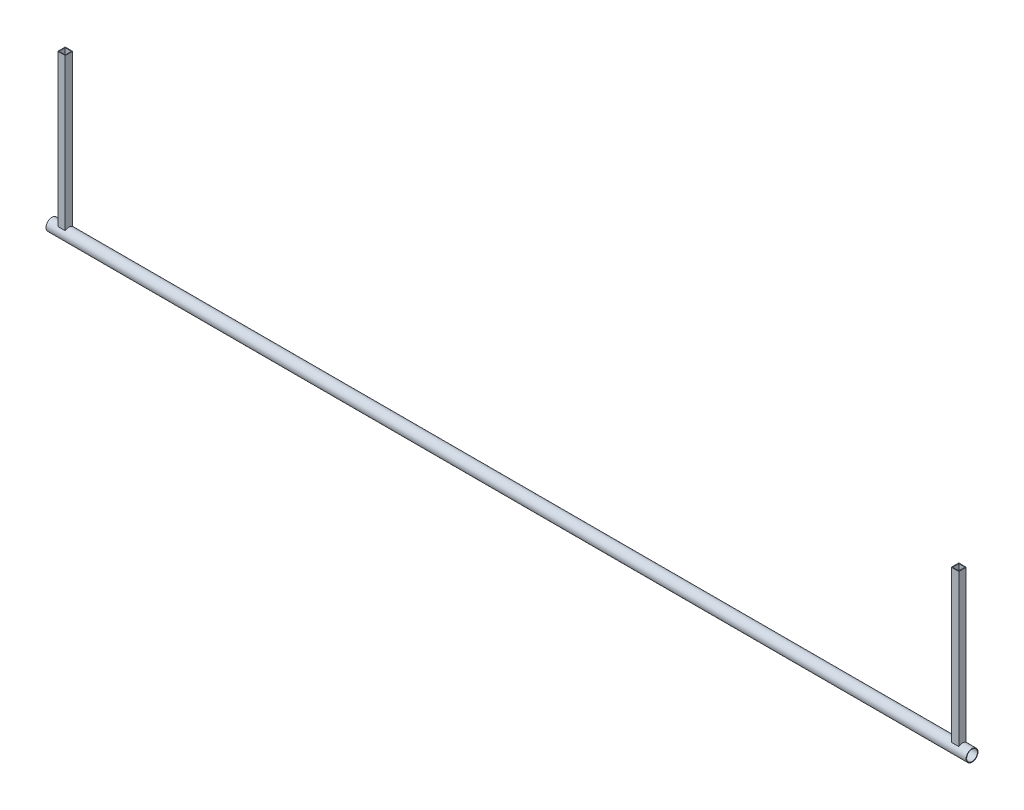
from build123d import *

# Parameters (mm, degrees)
ESQUISSE1_R             = 20
BOSS_EXTRU_1_DEPTH      = 3090
ESQUISSE2_W             = 25
ESQUISSE2_H             = 25
ESQUISSE2_W_2           = 21
ESQUISSE2_H_2           = 21
BOSS_EXTRU_2_DEPTH      = 525
ESQUISSE3_R             = 18
ENL_V_MAT_EXTRU_1_DEPTH = 3135.346024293


with BuildPart() as part:
    # Esquisse1 → Boss.-Extru.1 (new body)
    with BuildSketch(Plane(origin=(0, 0, 0), x_dir=(0, 0, -1), z_dir=(1, 0, 0))):
        Circle(ESQUISSE1_R)
    extrude(amount=BOSS_EXTRU_1_DEPTH)

    # Esquisse2 → Boss.-Extru.2 (add)
    # profile 1 of 2: a face of its own
    with BuildSketch(Plane(origin=(0, 0, 0), x_dir=(1, 0, 0), z_dir=(0, 1, 0))):
        with Locations((44.5, 0)):
            Rectangle(ESQUISSE2_W, ESQUISSE2_H)
        with Locations((44.5, 0)):
            Rectangle(ESQUISSE2_W_2, ESQUISSE2_H_2, mode=Mode.SUBTRACT)
    # profile 2 of 2: a face of its own
    with BuildSketch(Plane(origin=(0, 0, 0), x_dir=(1, 0, 0), z_dir=(0, 1, 0))):
        with Locations((3045.5, 0)):
            Rectangle(ESQUISSE2_W, ESQUISSE2_H)
        with Locations((3045.5, 0)):
            Rectangle(ESQUISSE2_W_2, ESQUISSE2_H_2, mode=Mode.SUBTRACT)
    extrude(amount=BOSS_EXTRU_2_DEPTH)

    # Esquisse3 → Enl_v. mat.-Extru.1 (cut, through all)
    with BuildSketch(Plane.ZY):
        Circle(ESQUISSE3_R)
    extrude(amount=-ENL_V_MAT_EXTRU_1_DEPTH, mode=Mode.SUBTRACT)


solid = part.part
